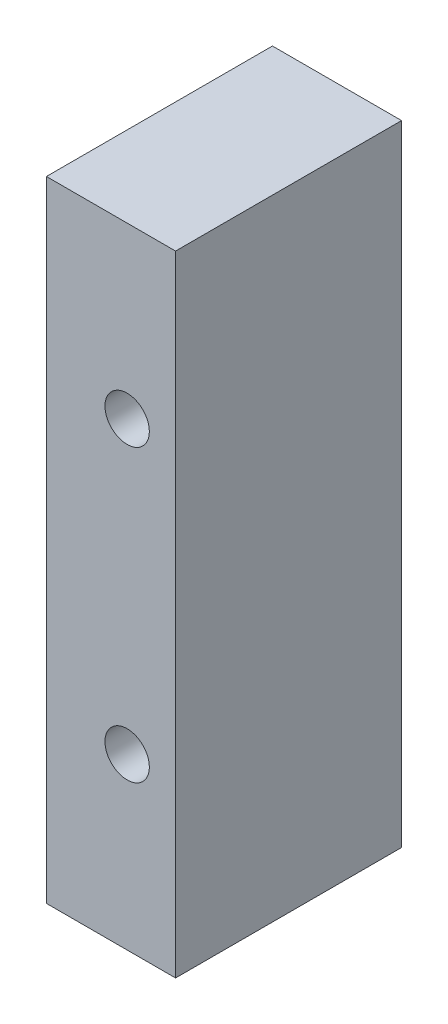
from build123d import *

# Parameters (mm, degrees)
ESQUISSE1_W             = 16
ESQUISSE1_H             = 78
EXTRUSION1_DEPTH        = 28
ESQUISSE2_R             = 2.75
ENL_V_MAT_EXTRU_1_DEPTH = 49.672374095


with BuildPart() as part:
    # Esquisse1 → Extrusion1 (new body)
    with BuildSketch(Plane.XY):
        Rectangle(ESQUISSE1_W, ESQUISSE1_H)
    extrude(amount=EXTRUSION1_DEPTH)

    # Esquisse2 → Enl_v. mat.-Extru.1 (cut, through all)
    with BuildSketch(Plane.XY.offset(28)):
        with Locations((2, 18)):
            Circle(ESQUISSE2_R)
        with Locations((2, -18)):
            Circle(ESQUISSE2_R)
    extrude(amount=-ENL_V_MAT_EXTRU_1_DEPTH, mode=Mode.SUBTRACT)


solid = part.part
